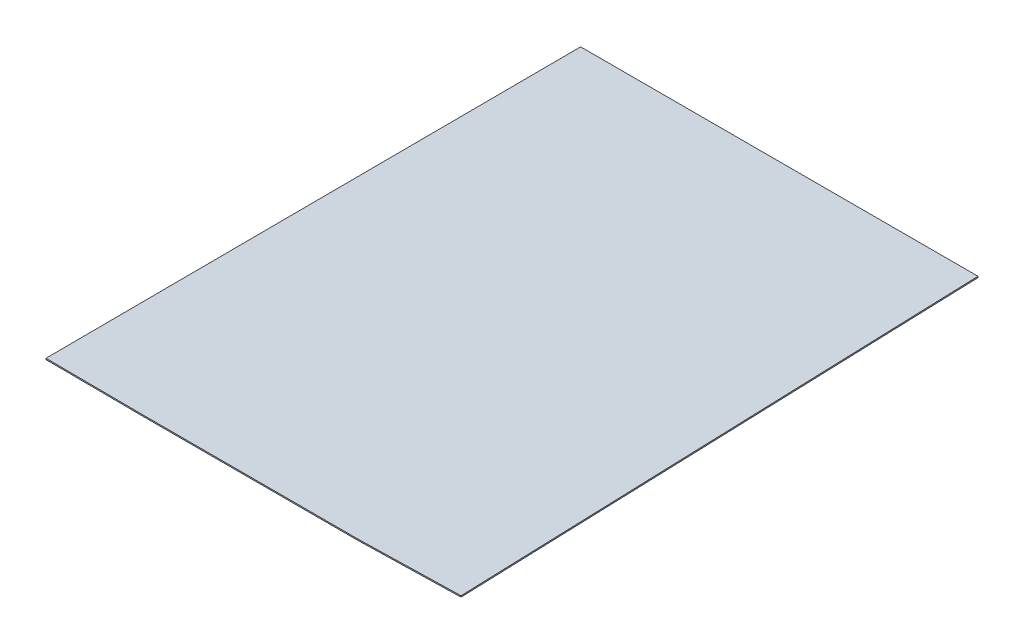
ISO-10303-21;
HEADER;
FILE_DESCRIPTION(('STEP AP214'),'2;1');
FILE_NAME('part.step','',(''),(''),'','','');
FILE_SCHEMA(('AUTOMOTIVE_DESIGN { 1 0 10303 214 1 1 1 1 }'));
ENDSEC;
DATA;
#1=APPLICATION_CONTEXT('core data for automotive mechanical design processes');
#2=APPLICATION_PROTOCOL_DEFINITION('international standard','automotive_design',2000,#1);
#3=PRODUCT_CONTEXT('',#1,'mechanical');
#4=PRODUCT('Part','Part','',(#3));
#5=PRODUCT_RELATED_PRODUCT_CATEGORY('part','',(#4));
#6=PRODUCT_DEFINITION_FORMATION('','',#4);
#7=PRODUCT_DEFINITION_CONTEXT('part definition',#1,'design');
#8=PRODUCT_DEFINITION('design','',#6,#7);
#9=PRODUCT_DEFINITION_SHAPE('','',#8);
#10=(LENGTH_UNIT() NAMED_UNIT(*) SI_UNIT(.MILLI.,.METRE.));
#11=(NAMED_UNIT(*) PLANE_ANGLE_UNIT() SI_UNIT($,.RADIAN.));
#12=(NAMED_UNIT(*) SI_UNIT($,.STERADIAN.) SOLID_ANGLE_UNIT());
#13=UNCERTAINTY_MEASURE_WITH_UNIT(LENGTH_MEASURE(1.E-05),#10,'distance_accuracy_value','');
#14=(GEOMETRIC_REPRESENTATION_CONTEXT(3) GLOBAL_UNCERTAINTY_ASSIGNED_CONTEXT((#13)) GLOBAL_UNIT_ASSIGNED_CONTEXT((#10,
#11,#12)) REPRESENTATION_CONTEXT('',''));
#15=CARTESIAN_POINT('',(0.,0.,0.));
#16=DIRECTION('',(0.,0.,1.));
#17=DIRECTION('',(1.,0.,0.));
#18=AXIS2_PLACEMENT_3D('',#15,#16,#17);
#19=CARTESIAN_POINT('',(-308.059422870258,996.306985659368,-61.5121412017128));
#20=DIRECTION('',(0.,0.00961724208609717,-0.999953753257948));
#21=DIRECTION('',(0.,0.999953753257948,0.00961724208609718));
#22=AXIS2_PLACEMENT_3D('',#19,#20,#21);
#23=PLANE('',#22);
#24=DIRECTION('',(0.,-0.999953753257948,-0.00961724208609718));
#25=VECTOR('',#24,1.);
#26=CARTESIAN_POINT('',(153.597358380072,-26.3473666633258,-71.3477105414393));
#27=LINE('',#26,#25);
#28=CARTESIAN_POINT('',(153.597358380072,-26.3473666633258,-71.3477105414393));
#29=VERTEX_POINT('',#28);
#30=CARTESIAN_POINT('',(153.597358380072,-25.3474129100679,-71.3380932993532));
#31=VERTEX_POINT('',#30);
#32=EDGE_CURVE('E383',#29,#31,#27,.F.);
#33=ORIENTED_EDGE('',*,*,#32,.F.);
#34=DIRECTION('',(1.,0.,0.));
#35=VECTOR('',#34,1.);
#36=CARTESIAN_POINT('',(68.8369167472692,-26.3473666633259,-71.3477105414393));
#37=LINE('',#36,#35);
#38=CARTESIAN_POINT('',(-167.008019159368,-26.3473666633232,-71.3477105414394));
#39=VERTEX_POINT('',#38);
#40=EDGE_CURVE('E320',#39,#29,#37,.T.);
#41=ORIENTED_EDGE('',*,*,#40,.F.);
#42=DIRECTION('',(0.,-0.999953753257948,-0.00961724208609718));
#43=VECTOR('',#42,1.);
#44=CARTESIAN_POINT('',(-167.008019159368,-26.3473666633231,-71.3477105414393));
#45=LINE('',#44,#43);
#46=CARTESIAN_POINT('',(-167.008019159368,-25.3474129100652,-71.3380932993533));
#47=VERTEX_POINT('',#46);
#48=EDGE_CURVE('E15',#47,#39,#45,.T.);
#49=ORIENTED_EDGE('',*,*,#48,.F.);
#50=DIRECTION('',(1.,0.,0.));
#51=VECTOR('',#50,1.);
#52=CARTESIAN_POINT('',(68.8369167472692,-25.3474129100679,-71.3380932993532));
#53=LINE('',#52,#51);
#54=EDGE_CURVE('E367',#47,#31,#53,.T.);
#55=ORIENTED_EDGE('',*,*,#54,.T.);
#56=EDGE_LOOP('',(#33,#41,#49,#55));
#57=FACE_BOUND('',#56,.T.);
#58=ADVANCED_FACE('F305',(#57),#23,.T.);
#59=CARTESIAN_POINT('',(68.8369167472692,-22.3298997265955,-385.084342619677));
#60=DIRECTION('',(0.,-0.999953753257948,-0.00961724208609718));
#61=DIRECTION('',(0.,0.00961724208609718,-0.999953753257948));
#62=AXIS2_PLACEMENT_3D('',#59,#60,#61);
#63=PLANE('',#62);
#64=ORIENTED_EDGE('',*,*,#54,.F.);
#65=DIRECTION('',(0.00512914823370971,0.00961711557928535,-0.999940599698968));
#66=VECTOR('',#65,1.);
#67=CARTESIAN_POINT('',(-169.20910548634,-29.4744337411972,357.769329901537));
#68=LINE('',#67,#66);
#69=CARTESIAN_POINT('',(-169.209105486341,-29.4744337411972,357.769329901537));
#70=VERTEX_POINT('',#69);
#71=EDGE_CURVE('E378',#70,#47,#68,.T.);
#72=ORIENTED_EDGE('',*,*,#71,.F.);
#73=DIRECTION('',(-0.999980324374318,6.03292166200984E-05,-0.00627273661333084));
#74=VECTOR('',#73,1.);
#75=CARTESIAN_POINT('',(-103.094059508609,-29.4784224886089,358.184060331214));
#76=LINE('',#75,#74);
#77=CARTESIAN_POINT('',(-95.9449353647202,-29.4788537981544,358.228905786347));
#78=VERTEX_POINT('',#77);
#79=EDGE_CURVE('E554',#70,#78,#76,.F.);
#80=ORIENTED_EDGE('',*,*,#79,.T.);
#81=DIRECTION('',(0.999987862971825,-4.7382765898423E-05,0.00492662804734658));
#82=VECTOR('',#81,1.);
#83=CARTESIAN_POINT('',(-95.9449031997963,-29.4788538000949,358.228905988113));
#84=LINE('',#83,#82);
#85=CARTESIAN_POINT('',(-88.7081360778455,-29.4791967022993,358.264559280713));
#86=VERTEX_POINT('',#85);
#87=EDGE_CURVE('E546',#78,#86,#84,.T.);
#88=ORIENTED_EDGE('',*,*,#87,.T.);
#89=DIRECTION('',(1.,0.,0.));
#90=VECTOR('',#89,1.);
#91=CARTESIAN_POINT('',(68.8369167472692,-29.4791967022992,358.264559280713));
#92=LINE('',#91,#90);
#93=CARTESIAN_POINT('',(79.6503634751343,-29.4791967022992,358.264559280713));
#94=VERTEX_POINT('',#93);
#95=EDGE_CURVE('E496',#86,#94,#92,.T.);
#96=ORIENTED_EDGE('',*,*,#95,.T.);
#97=CARTESIAN_POINT('',(86.8864180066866,-29.4783944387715,358.181143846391));
#98=CARTESIAN_POINT('',(83.5887660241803,-29.4791619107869,358.260941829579));
#99=CARTESIAN_POINT('',(79.6502235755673,-29.4791967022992,358.264559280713));
#100=B_SPLINE_CURVE_WITH_KNOTS('',2,(#97,#98,#99),.UNSPECIFIED.,.F.,.F.,(3,3),(0.,1.),.UNSPECIFIED.);
#101=CARTESIAN_POINT('',(86.8864180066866,-29.4783944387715,358.181143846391));
#102=VERTEX_POINT('',#101);
#103=EDGE_CURVE('E327',#102,#94,#100,.T.);
#104=ORIENTED_EDGE('',*,*,#103,.F.);
#105=DIRECTION('',(0.999708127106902,0.000232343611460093,-0.0241579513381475));
#106=VECTOR('',#105,1.);
#107=CARTESIAN_POINT('',(163.747890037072,-29.4605309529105,356.323786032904));
#108=LINE('',#107,#106);
#109=CARTESIAN_POINT('',(164.183093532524,-29.4604298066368,356.313269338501));
#110=VERTEX_POINT('',#109);
#111=EDGE_CURVE('E567',#102,#110,#108,.T.);
#112=ORIENTED_EDGE('',*,*,#111,.T.);
#113=DIRECTION('',(-0.0247444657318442,0.00961429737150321,-0.999647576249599));
#114=VECTOR('',#113,1.);
#115=CARTESIAN_POINT('',(164.183093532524,-29.4604298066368,356.313269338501));
#116=LINE('',#115,#114);
#117=EDGE_CURVE('E382',#110,#31,#116,.T.);
#118=ORIENTED_EDGE('',*,*,#117,.T.);
#119=EDGE_LOOP('',(#64,#72,#80,#88,#96,#104,#112,#118));
#120=FACE_BOUND('',#119,.T.);
#121=ADVANCED_FACE('F376',(#120),#63,.F.);
#122=CARTESIAN_POINT('',(68.8369167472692,-23.3298534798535,-385.093959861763));
#123=DIRECTION('',(0.,-0.999953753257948,-0.00961724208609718));
#124=DIRECTION('',(0.,0.00961724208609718,-0.999953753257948));
#125=AXIS2_PLACEMENT_3D('',#122,#123,#124);
#126=PLANE('',#125);
#127=DIRECTION('',(0.00512914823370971,0.00961711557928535,-0.999940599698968));
#128=VECTOR('',#127,1.);
#129=CARTESIAN_POINT('',(-169.209105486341,-30.4743874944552,357.759712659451));
#130=LINE('',#129,#128);
#131=CARTESIAN_POINT('',(-169.209105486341,-30.4743874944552,357.759712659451));
#132=VERTEX_POINT('',#131);
#133=EDGE_CURVE('E387',#132,#39,#130,.T.);
#134=ORIENTED_EDGE('',*,*,#133,.T.);
#135=ORIENTED_EDGE('',*,*,#40,.T.);
#136=DIRECTION('',(-0.0247444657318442,0.00961429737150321,-0.999647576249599));
#137=VECTOR('',#136,1.);
#138=CARTESIAN_POINT('',(164.183093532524,-30.4603835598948,356.303652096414));
#139=LINE('',#138,#137);
#140=CARTESIAN_POINT('',(164.183093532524,-30.4603835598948,356.303652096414));
#141=VERTEX_POINT('',#140);
#142=EDGE_CURVE('E564',#141,#29,#139,.T.);
#143=ORIENTED_EDGE('',*,*,#142,.F.);
#144=DIRECTION('',(0.999708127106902,0.000232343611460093,-0.0241579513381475));
#145=VECTOR('',#144,1.);
#146=CARTESIAN_POINT('',(86.8864180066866,-30.4783481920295,358.171526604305));
#147=LINE('',#146,#145);
#148=CARTESIAN_POINT('',(86.8864180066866,-30.4783481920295,358.171526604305));
#149=VERTEX_POINT('',#148);
#150=EDGE_CURVE('E503',#149,#141,#147,.T.);
#151=ORIENTED_EDGE('',*,*,#150,.F.);
#152=CARTESIAN_POINT('',(86.8864180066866,-30.4783481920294,358.171526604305));
#153=CARTESIAN_POINT('',(83.5887660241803,-30.4791156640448,358.251324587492));
#154=CARTESIAN_POINT('',(79.6502235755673,-30.4791504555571,358.254942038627));
#155=B_SPLINE_CURVE_WITH_KNOTS('',2,(#152,#153,#154),.UNSPECIFIED.,.F.,.F.,(3,3),(0.,1.),.UNSPECIFIED.);
#156=CARTESIAN_POINT('',(79.6502235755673,-30.4791504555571,358.254942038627));
#157=VERTEX_POINT('',#156);
#158=EDGE_CURVE('E490',#149,#157,#155,.T.);
#159=ORIENTED_EDGE('',*,*,#158,.T.);
#160=DIRECTION('',(1.,0.,0.));
#161=VECTOR('',#160,1.);
#162=CARTESIAN_POINT('',(-88.7081360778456,-30.4791504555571,358.254942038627));
#163=LINE('',#162,#161);
#164=CARTESIAN_POINT('',(-88.7081360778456,-30.4791504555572,358.254942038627));
#165=VERTEX_POINT('',#164);
#166=EDGE_CURVE('E500',#165,#157,#163,.T.);
#167=ORIENTED_EDGE('',*,*,#166,.F.);
#168=DIRECTION('',(0.999987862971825,-4.73827659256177E-05,0.00492662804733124));
#169=VECTOR('',#168,1.);
#170=CARTESIAN_POINT('',(-95.9449031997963,-30.4788075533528,358.219288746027));
#171=LINE('',#170,#169);
#172=CARTESIAN_POINT('',(-95.9449031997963,-30.4788075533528,358.219288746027));
#173=VERTEX_POINT('',#172);
#174=EDGE_CURVE('E550',#173,#165,#171,.T.);
#175=ORIENTED_EDGE('',*,*,#174,.F.);
#176=DIRECTION('',(0.999980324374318,-6.03292166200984E-05,0.00627273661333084));
#177=VECTOR('',#176,1.);
#178=CARTESIAN_POINT('',(-169.209105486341,-30.4743874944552,357.759712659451));
#179=LINE('',#178,#177);
#180=EDGE_CURVE('E389',#132,#173,#179,.T.);
#181=ORIENTED_EDGE('',*,*,#180,.F.);
#182=EDGE_LOOP('',(#134,#135,#143,#151,#159,#167,#175,#181));
#183=FACE_BOUND('',#182,.T.);
#184=ADVANCED_FACE('F307',(#183),#126,.T.);
#185=CARTESIAN_POINT('',(164.183093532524,-30.4603835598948,356.303652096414));
#186=DIRECTION('',(-0.999693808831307,-0.000237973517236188,0.0247433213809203));
#187=DIRECTION('',(-0.0247444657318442,0.00961429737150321,-0.999647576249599));
#188=AXIS2_PLACEMENT_3D('',#185,#186,#187);
#189=PLANE('',#188);
#190=ORIENTED_EDGE('',*,*,#142,.T.);
#191=ORIENTED_EDGE('',*,*,#32,.T.);
#192=ORIENTED_EDGE('',*,*,#117,.F.);
#193=DIRECTION('',(0.,0.999953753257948,0.0096172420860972));
#194=VECTOR('',#193,1.);
#195=CARTESIAN_POINT('',(164.183093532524,-30.4603835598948,356.303652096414));
#196=LINE('',#195,#194);
#197=EDGE_CURVE('E447',#141,#110,#196,.T.);
#198=ORIENTED_EDGE('',*,*,#197,.F.);
#199=EDGE_LOOP('',(#190,#191,#192,#198));
#200=FACE_BOUND('',#199,.T.);
#201=ADVANCED_FACE('F421',(#200),#189,.F.);
#202=CARTESIAN_POINT('',(-169.209105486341,-30.4743874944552,357.759712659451));
#203=DIRECTION('',(-0.999986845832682,4.93282602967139E-05,-0.00512891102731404));
#204=DIRECTION('',(0.00512914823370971,0.00961711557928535,-0.999940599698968));
#205=AXIS2_PLACEMENT_3D('',#202,#203,#204);
#206=PLANE('',#205);
#207=ORIENTED_EDGE('',*,*,#71,.T.);
#208=ORIENTED_EDGE('',*,*,#48,.T.);
#209=ORIENTED_EDGE('',*,*,#133,.F.);
#210=DIRECTION('',(0.,0.999953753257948,0.00961724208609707));
#211=VECTOR('',#210,1.);
#212=CARTESIAN_POINT('',(-169.209105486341,-30.4743874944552,357.759712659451));
#213=LINE('',#212,#211);
#214=EDGE_CURVE('E386',#132,#70,#213,.T.);
#215=ORIENTED_EDGE('',*,*,#214,.T.);
#216=EDGE_LOOP('',(#207,#208,#209,#215));
#217=FACE_BOUND('',#216,.T.);
#218=ADVANCED_FACE('F385',(#217),#206,.T.);
#219=CARTESIAN_POINT('',(-88.7081360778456,-30.4791504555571,358.254942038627));
#220=DIRECTION('',(0.,0.00961724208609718,-0.999953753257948));
#221=DIRECTION('',(1.,0.,0.));
#222=AXIS2_PLACEMENT_3D('',#219,#220,#221);
#223=PLANE('',#222);
#224=CARTESIAN_POINT('',(-88.7081360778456,-30.4791504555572,358.254942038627));
#225=DIRECTION('',(0.,0.999953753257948,0.00961724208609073));
#226=VECTOR('',#225,1.);
#227=LINE('',#224,#226);
#228=EDGE_CURVE('E313',#165,#86,#227,.T.);
#229=ORIENTED_EDGE('',*,*,#228,.F.);
#230=ORIENTED_EDGE('',*,*,#166,.T.);
#231=CARTESIAN_POINT('',(79.6502235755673,-29.4791967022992,358.264559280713));
#232=CARTESIAN_POINT('',(79.6502235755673,-30.4791504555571,358.254942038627));
#233=B_SPLINE_CURVE_WITH_KNOTS('',1,(#231,#232),.UNSPECIFIED.,.F.,.F.,(2,2),(0.,1.),.UNSPECIFIED.);
#234=EDGE_CURVE('E488',#157,#94,#233,.F.);
#235=ORIENTED_EDGE('',*,*,#234,.T.);
#236=ORIENTED_EDGE('',*,*,#95,.F.);
#237=EDGE_LOOP('',(#229,#230,#235,#236));
#238=FACE_BOUND('',#237,.T.);
#239=ADVANCED_FACE('F463',(#238),#223,.F.);
#240=CARTESIAN_POINT('',(86.8864180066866,-29.4783944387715,358.181143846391));
#241=CARTESIAN_POINT('',(84.6879833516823,-29.4789060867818,358.234342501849));
#242=CARTESIAN_POINT('',(82.2759185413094,-29.4791735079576,358.262147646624));
#243=CARTESIAN_POINT('',(79.6502235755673,-29.4791967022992,358.264559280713));
#244=CARTESIAN_POINT('',(86.8864180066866,-30.4783481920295,358.171526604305));
#245=CARTESIAN_POINT('',(84.6879833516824,-30.4788598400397,358.224725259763));
#246=CARTESIAN_POINT('',(82.2759185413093,-30.4791272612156,358.252530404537));
#247=CARTESIAN_POINT('',(79.6502235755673,-30.4791504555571,358.254942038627));
#248=B_SPLINE_SURFACE_WITH_KNOTS('',1,3,((#240,#241,#242,#243),(#244,#245,#246,#247)),
.UNSPECIFIED.,.F.,.F.,.F.,(2,2),(4,4),(0.,1.),(0.,1.),.UNSPECIFIED.);
#249=CARTESIAN_POINT('',(86.8864180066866,-30.4783481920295,358.171526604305));
#250=CARTESIAN_POINT('',(86.8864180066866,-29.4783944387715,358.181143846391));
#251=B_SPLINE_CURVE_WITH_KNOTS('',1,(#249,#250),.UNSPECIFIED.,.F.,.F.,(2,2),(0.,1.),.UNSPECIFIED.);
#252=EDGE_CURVE('E443',#149,#102,#251,.T.);
#253=ORIENTED_EDGE('',*,*,#234,.F.);
#254=ORIENTED_EDGE('',*,*,#158,.F.);
#255=ORIENTED_EDGE('',*,*,#252,.T.);
#256=ORIENTED_EDGE('',*,*,#103,.T.);
#257=EDGE_LOOP('',(#253,#254,#255,#256));
#258=FACE_BOUND('',#257,.T.);
#259=ADVANCED_FACE('F457',(#258),#248,.F.);
#260=CARTESIAN_POINT('',(86.8864180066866,-30.4783481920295,358.171526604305));
#261=DIRECTION('',(-0.024159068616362,0.00961443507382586,-0.999661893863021));
#262=DIRECTION('',(0.999708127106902,0.000232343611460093,-0.0241579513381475));
#263=AXIS2_PLACEMENT_3D('',#260,#261,#262);
#264=PLANE('',#263);
#265=ORIENTED_EDGE('',*,*,#252,.F.);
#266=ORIENTED_EDGE('',*,*,#150,.T.);
#267=ORIENTED_EDGE('',*,*,#197,.T.);
#268=ORIENTED_EDGE('',*,*,#111,.F.);
#269=EDGE_LOOP('',(#265,#266,#267,#268));
#270=FACE_BOUND('',#269,.T.);
#271=ADVANCED_FACE('F419',(#270),#264,.F.);
#272=CARTESIAN_POINT('',(-95.9449031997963,-29.4788538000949,358.228905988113));
#273=DIRECTION('',(-0.00492685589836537,-0.00961712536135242,0.999941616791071));
#274=DIRECTION('',(0.,-0.999953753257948,-0.00961724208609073));
#275=AXIS2_PLACEMENT_3D('',#272,#273,#274);
#276=PLANE('',#275);
#277=CARTESIAN_POINT('',(-95.9449031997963,-30.4788075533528,358.219288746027));
#278=DIRECTION('',(-3.21649238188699E-05,0.999953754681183,0.00961704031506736));
#279=VECTOR('',#278,1.);
#280=LINE('',#277,#279);
#281=EDGE_CURVE('E398',#173,#78,#280,.T.);
#282=ORIENTED_EDGE('',*,*,#281,.F.);
#283=ORIENTED_EDGE('',*,*,#174,.T.);
#284=ORIENTED_EDGE('',*,*,#228,.T.);
#285=ORIENTED_EDGE('',*,*,#87,.F.);
#286=EDGE_LOOP('',(#282,#283,#284,#285));
#287=FACE_BOUND('',#286,.T.);
#288=ADVANCED_FACE('F414',(#287),#276,.T.);
#289=CARTESIAN_POINT('',(-169.209105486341,-30.4743874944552,357.759712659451));
#290=DIRECTION('',(0.00627302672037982,0.00961705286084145,-0.999934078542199));
#291=DIRECTION('',(0.999980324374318,-6.03292166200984E-05,0.00627273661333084));
#292=AXIS2_PLACEMENT_3D('',#289,#290,#291);
#293=PLANE('',#292);
#294=ORIENTED_EDGE('',*,*,#214,.F.);
#295=ORIENTED_EDGE('',*,*,#180,.T.);
#296=ORIENTED_EDGE('',*,*,#281,.T.);
#297=ORIENTED_EDGE('',*,*,#79,.F.);
#298=EDGE_LOOP('',(#294,#295,#296,#297));
#299=FACE_BOUND('',#298,.T.);
#300=ADVANCED_FACE('F404',(#299),#293,.F.);
#301=CLOSED_SHELL('',(#58,#121,#184,#201,#218,#239,#259,#271,#288,#300));
#302=MANIFOLD_SOLID_BREP('B2',#301);
#303=ADVANCED_BREP_SHAPE_REPRESENTATION('',(#18,#302),#14);
#304=SHAPE_DEFINITION_REPRESENTATION(#9,#303);
ENDSEC;
END-ISO-10303-21;
